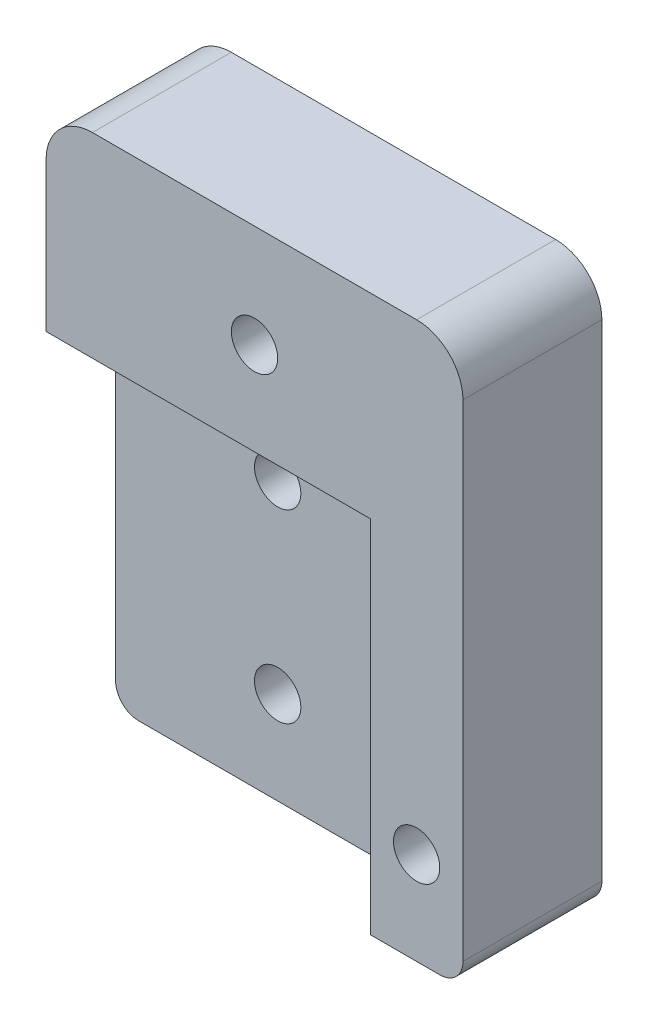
ISO-10303-21;
HEADER;
FILE_DESCRIPTION(('STEP AP214'),'2;1');
FILE_NAME('part.step','',(''),(''),'','','');
FILE_SCHEMA(('AUTOMOTIVE_DESIGN { 1 0 10303 214 1 1 1 1 }'));
ENDSEC;
DATA;
#1=APPLICATION_CONTEXT('core data for automotive mechanical design processes');
#2=APPLICATION_PROTOCOL_DEFINITION('international standard','automotive_design',2000,#1);
#3=PRODUCT_CONTEXT('',#1,'mechanical');
#4=PRODUCT('Part','Part','',(#3));
#5=PRODUCT_RELATED_PRODUCT_CATEGORY('part','',(#4));
#6=PRODUCT_DEFINITION_FORMATION('','',#4);
#7=PRODUCT_DEFINITION_CONTEXT('part definition',#1,'design');
#8=PRODUCT_DEFINITION('design','',#6,#7);
#9=PRODUCT_DEFINITION_SHAPE('','',#8);
#10=(LENGTH_UNIT() NAMED_UNIT(*) SI_UNIT(.MILLI.,.METRE.));
#11=(NAMED_UNIT(*) PLANE_ANGLE_UNIT() SI_UNIT($,.RADIAN.));
#12=(NAMED_UNIT(*) SI_UNIT($,.STERADIAN.) SOLID_ANGLE_UNIT());
#13=UNCERTAINTY_MEASURE_WITH_UNIT(LENGTH_MEASURE(1.E-05),#10,'distance_accuracy_value','');
#14=(GEOMETRIC_REPRESENTATION_CONTEXT(3) GLOBAL_UNCERTAINTY_ASSIGNED_CONTEXT((#13)) GLOBAL_UNIT_ASSIGNED_CONTEXT((#10,
#11,#12)) REPRESENTATION_CONTEXT('',''));
#15=CARTESIAN_POINT('',(0.,0.,0.));
#16=DIRECTION('',(0.,0.,1.));
#17=DIRECTION('',(1.,0.,0.));
#18=AXIS2_PLACEMENT_3D('',#15,#16,#17);
#19=CARTESIAN_POINT('',(3.175,3.175,19.05));
#20=DIRECTION('',(0.,0.,-1.));
#21=DIRECTION('',(-1.,0.,0.));
#22=AXIS2_PLACEMENT_3D('',#19,#20,#21);
#23=CYLINDRICAL_SURFACE('',#22,3.175);
#24=DIRECTION('',(0.,0.,-1.));
#25=VECTOR('',#24,1.);
#26=CARTESIAN_POINT('',(3.17500000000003,0.,19.05));
#27=LINE('',#26,#25);
#28=CARTESIAN_POINT('',(3.17500000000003,0.,9.525));
#29=VERTEX_POINT('',#28);
#30=CARTESIAN_POINT('',(3.17500000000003,0.,0.));
#31=VERTEX_POINT('',#30);
#32=EDGE_CURVE('E142',#29,#31,#27,.T.);
#33=ORIENTED_EDGE('',*,*,#32,.F.);
#34=CARTESIAN_POINT('',(3.175,3.175,9.525));
#35=DIRECTION('',(0.,0.,1.));
#36=DIRECTION('',(1.,0.,0.));
#37=AXIS2_PLACEMENT_3D('',#34,#35,#36);
#38=CIRCLE('',#37,3.175);
#39=CARTESIAN_POINT('',(0.,3.17500000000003,9.525));
#40=VERTEX_POINT('',#39);
#41=EDGE_CURVE('E203',#40,#29,#38,.T.);
#42=ORIENTED_EDGE('',*,*,#41,.F.);
#43=DIRECTION('',(0.,0.,-1.));
#44=VECTOR('',#43,1.);
#45=CARTESIAN_POINT('',(0.,3.17500000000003,19.05));
#46=LINE('',#45,#44);
#47=CARTESIAN_POINT('',(0.,3.17500000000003,0.));
#48=VERTEX_POINT('',#47);
#49=EDGE_CURVE('E139',#40,#48,#46,.T.);
#50=ORIENTED_EDGE('',*,*,#49,.T.);
#51=CARTESIAN_POINT('',(3.175,3.175,0.));
#52=DIRECTION('',(0.,0.,1.));
#53=DIRECTION('',(1.,0.,0.));
#54=AXIS2_PLACEMENT_3D('',#51,#52,#53);
#55=CIRCLE('',#54,3.175);
#56=EDGE_CURVE('E167',#31,#48,#55,.F.);
#57=ORIENTED_EDGE('',*,*,#56,.F.);
#58=EDGE_LOOP('',(#33,#42,#50,#57));
#59=FACE_BOUND('',#58,.T.);
#60=ADVANCED_FACE('F35',(#59),#23,.T.);
#61=CARTESIAN_POINT('',(28.575,0.,19.05));
#62=DIRECTION('',(0.,1.,0.));
#63=DIRECTION('',(0.,0.,1.));
#64=AXIS2_PLACEMENT_3D('',#61,#62,#63);
#65=PLANE('',#64);
#66=DIRECTION('',(0.,0.,1.));
#67=VECTOR('',#66,1.);
#68=CARTESIAN_POINT('',(44.45,0.,9.525));
#69=LINE('',#68,#67);
#70=CARTESIAN_POINT('',(44.45,0.,9.525));
#71=VERTEX_POINT('',#70);
#72=CARTESIAN_POINT('',(44.45,0.,19.05));
#73=VERTEX_POINT('',#72);
#74=EDGE_CURVE('E219',#71,#73,#69,.T.);
#75=ORIENTED_EDGE('',*,*,#74,.F.);
#76=DIRECTION('',(1.,0.,0.));
#77=VECTOR('',#76,1.);
#78=CARTESIAN_POINT('',(28.575,0.,9.525));
#79=LINE('',#78,#77);
#80=EDGE_CURVE('E196',#29,#71,#79,.T.);
#81=ORIENTED_EDGE('',*,*,#80,.F.);
#82=ORIENTED_EDGE('',*,*,#32,.T.);
#83=DIRECTION('',(1.,0.,0.));
#84=VECTOR('',#83,1.);
#85=CARTESIAN_POINT('',(28.575,0.,0.));
#86=LINE('',#85,#84);
#87=CARTESIAN_POINT('',(53.975,0.,0.));
#88=VERTEX_POINT('',#87);
#89=EDGE_CURVE('E170',#31,#88,#86,.T.);
#90=ORIENTED_EDGE('',*,*,#89,.T.);
#91=DIRECTION('',(0.,0.,-1.));
#92=VECTOR('',#91,1.);
#93=CARTESIAN_POINT('',(53.975,0.,19.05));
#94=LINE('',#93,#92);
#95=CARTESIAN_POINT('',(53.975,0.,19.05));
#96=VERTEX_POINT('',#95);
#97=EDGE_CURVE('E185',#96,#88,#94,.T.);
#98=ORIENTED_EDGE('',*,*,#97,.F.);
#99=DIRECTION('',(1.,0.,0.));
#100=VECTOR('',#99,1.);
#101=CARTESIAN_POINT('',(28.575,0.,19.05));
#102=LINE('',#101,#100);
#103=EDGE_CURVE('E124',#73,#96,#102,.T.);
#104=ORIENTED_EDGE('',*,*,#103,.F.);
#105=EDGE_LOOP('',(#75,#81,#82,#90,#98,#104));
#106=FACE_BOUND('',#105,.T.);
#107=ADVANCED_FACE('F192',(#106),#65,.F.);
#108=CARTESIAN_POINT('',(22.225,38.1,19.05));
#109=DIRECTION('',(0.,0.,-1.));
#110=DIRECTION('',(-1.,0.,0.));
#111=AXIS2_PLACEMENT_3D('',#108,#109,#110);
#112=CYLINDRICAL_SURFACE('',#111,3.175);
#113=CARTESIAN_POINT('',(22.225,38.1,0.));
#114=DIRECTION('',(0.,0.,1.));
#115=DIRECTION('',(1.,0.,0.));
#116=AXIS2_PLACEMENT_3D('',#113,#114,#115);
#117=CIRCLE('',#116,3.175);
#118=CARTESIAN_POINT('',(19.05,38.1,0.));
#119=VERTEX_POINT('',#118);
#120=EDGE_CURVE('E173',#119,#119,#117,.T.);
#121=CARTESIAN_POINT('',(22.225,38.1,9.525));
#122=DIRECTION('',(0.,0.,1.));
#123=DIRECTION('',(1.,0.,0.));
#124=AXIS2_PLACEMENT_3D('',#121,#122,#123);
#125=CIRCLE('',#124,3.175);
#126=CARTESIAN_POINT('',(19.05,38.1,9.525));
#127=VERTEX_POINT('',#126);
#128=EDGE_CURVE('E225',#127,#127,#125,.F.);
#129=CARTESIAN_POINT('',(19.05,38.1,0.));
#130=CARTESIAN_POINT('',(19.05,38.1,0.0992187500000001));
#131=CARTESIAN_POINT('',(19.05,38.1,0.1984375));
#132=CARTESIAN_POINT('',(19.05,38.1,0.396875));
#133=CARTESIAN_POINT('',(19.05,38.1,0.49609375));
#134=CARTESIAN_POINT('',(19.05,38.1,0.69453125));
#135=CARTESIAN_POINT('',(19.05,38.1,0.79375));
#136=CARTESIAN_POINT('',(19.05,38.1,0.992187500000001));
#137=CARTESIAN_POINT('',(19.05,38.1,1.09140625));
#138=CARTESIAN_POINT('',(19.05,38.1,1.28984375));
#139=CARTESIAN_POINT('',(19.05,38.1,1.3890625));
#140=CARTESIAN_POINT('',(19.05,38.1,1.5875));
#141=CARTESIAN_POINT('',(19.05,38.1,1.68671875));
#142=CARTESIAN_POINT('',(19.05,38.1,1.88515625));
#143=CARTESIAN_POINT('',(19.05,38.1,1.984375));
#144=CARTESIAN_POINT('',(19.05,38.1,2.1828125));
#145=CARTESIAN_POINT('',(19.05,38.1,2.28203125));
#146=CARTESIAN_POINT('',(19.05,38.1,2.48046875));
#147=CARTESIAN_POINT('',(19.05,38.1,2.5796875));
#148=CARTESIAN_POINT('',(19.05,38.1,2.778125));
#149=CARTESIAN_POINT('',(19.05,38.1,2.87734375));
#150=CARTESIAN_POINT('',(19.05,38.1,3.07578125));
#151=CARTESIAN_POINT('',(19.05,38.1,3.175));
#152=CARTESIAN_POINT('',(19.05,38.1,3.3734375));
#153=CARTESIAN_POINT('',(19.05,38.1,3.47265625));
#154=CARTESIAN_POINT('',(19.05,38.1,3.67109375));
#155=CARTESIAN_POINT('',(19.05,38.1,3.7703125));
#156=CARTESIAN_POINT('',(19.05,38.1,3.96875));
#157=CARTESIAN_POINT('',(19.05,38.1,4.06796875));
#158=CARTESIAN_POINT('',(19.05,38.1,4.26640625));
#159=CARTESIAN_POINT('',(19.05,38.1,4.365625));
#160=CARTESIAN_POINT('',(19.05,38.1,4.5640625));
#161=CARTESIAN_POINT('',(19.05,38.1,4.66328125));
#162=CARTESIAN_POINT('',(19.05,38.1,4.86171875));
#163=CARTESIAN_POINT('',(19.05,38.1,4.9609375));
#164=CARTESIAN_POINT('',(19.05,38.1,5.159375));
#165=CARTESIAN_POINT('',(19.05,38.1,5.25859375));
#166=CARTESIAN_POINT('',(19.05,38.1,5.45703125));
#167=CARTESIAN_POINT('',(19.05,38.1,5.55625));
#168=CARTESIAN_POINT('',(19.05,38.1,5.7546875));
#169=CARTESIAN_POINT('',(19.05,38.1,5.85390625));
#170=CARTESIAN_POINT('',(19.05,38.1,6.05234375));
#171=CARTESIAN_POINT('',(19.05,38.1,6.1515625));
#172=CARTESIAN_POINT('',(19.05,38.1,6.35));
#173=CARTESIAN_POINT('',(19.05,38.1,6.44921875));
#174=CARTESIAN_POINT('',(19.05,38.1,6.64765625));
#175=CARTESIAN_POINT('',(19.05,38.1,6.746875));
#176=CARTESIAN_POINT('',(19.05,38.1,6.9453125));
#177=CARTESIAN_POINT('',(19.05,38.1,7.04453125));
#178=CARTESIAN_POINT('',(19.05,38.1,7.24296875));
#179=CARTESIAN_POINT('',(19.05,38.1,7.3421875));
#180=CARTESIAN_POINT('',(19.05,38.1,7.540625));
#181=CARTESIAN_POINT('',(19.05,38.1,7.63984375));
#182=CARTESIAN_POINT('',(19.05,38.1,7.83828125));
#183=CARTESIAN_POINT('',(19.05,38.1,7.9375));
#184=CARTESIAN_POINT('',(19.05,38.1,8.1359375));
#185=CARTESIAN_POINT('',(19.05,38.1,8.23515625));
#186=CARTESIAN_POINT('',(19.05,38.1,8.43359375));
#187=CARTESIAN_POINT('',(19.05,38.1,8.5328125));
#188=CARTESIAN_POINT('',(19.05,38.1,8.73125));
#189=CARTESIAN_POINT('',(19.05,38.1,8.83046875));
#190=CARTESIAN_POINT('',(19.05,38.1,9.02890625));
#191=CARTESIAN_POINT('',(19.05,38.1,9.128125));
#192=CARTESIAN_POINT('',(19.05,38.1,9.3265625));
#193=CARTESIAN_POINT('',(19.05,38.1,9.42578125));
#194=CARTESIAN_POINT('',(19.05,38.1,9.525));
#195=B_SPLINE_CURVE_WITH_KNOTS('',3,(#129,#130,#131,#132,#133,#134,#135,#136,#137,#138,#139,
#140,#141,#142,#143,#144,#145,#146,#147,#148,#149,#150,#151,#152,#153,#154,#155,#156,#157,#158,
#159,#160,#161,#162,#163,#164,#165,#166,#167,#168,#169,#170,#171,#172,#173,#174,#175,#176,#177,
#178,#179,#180,#181,#182,#183,#184,#185,#186,#187,#188,#189,#190,#191,#192,#193,#194),
.UNSPECIFIED.,.F.,.F.,(4,2,2,2,2,2,2,2,2,2,2,2,2,2,2,2,2,2,2,2,2,2,2,2,2,2,2,2,2,2,2,2,4),(0.,
0.29765625,0.5953125,0.892968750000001,1.190625,1.48828125,1.7859375,2.08359375,2.38125,
2.67890625,2.9765625,3.27421875,3.571875,3.86953125,4.1671875,4.46484375,4.7625,5.06015625,
5.3578125,5.65546875,5.953125,6.25078125,6.5484375,6.84609375,7.14375,7.44140625,7.7390625,
8.03671875,8.334375,8.63203125,8.9296875,9.22734375,9.525),.UNSPECIFIED.);
#196=EDGE_CURVE('BSEAM283',#119,#127,#195,.T.);
#197=ORIENTED_EDGE('',*,*,#120,.F.);
#198=ORIENTED_EDGE('',*,*,#128,.F.);
#199=ORIENTED_EDGE('',*,*,#196,.T.);
#200=ORIENTED_EDGE('',*,*,#196,.F.);
#201=EDGE_LOOP('',(#197,#199,#198,#200));
#202=FACE_BOUND('',#201,.T.);
#203=ADVANCED_FACE('F283',(#202),#112,.F.);
#204=CARTESIAN_POINT('',(22.225,12.7,19.05));
#205=DIRECTION('',(0.,0.,-1.));
#206=DIRECTION('',(-1.,0.,0.));
#207=AXIS2_PLACEMENT_3D('',#204,#205,#206);
#208=CYLINDRICAL_SURFACE('',#207,3.175);
#209=CARTESIAN_POINT('',(22.225,12.7,0.));
#210=DIRECTION('',(0.,0.,1.));
#211=DIRECTION('',(1.,0.,0.));
#212=AXIS2_PLACEMENT_3D('',#209,#210,#211);
#213=CIRCLE('',#212,3.175);
#214=CARTESIAN_POINT('',(19.05,12.7,0.));
#215=VERTEX_POINT('',#214);
#216=EDGE_CURVE('E245',#215,#215,#213,.T.);
#217=CARTESIAN_POINT('',(22.225,12.7,9.525));
#218=DIRECTION('',(0.,0.,1.));
#219=DIRECTION('',(1.,0.,0.));
#220=AXIS2_PLACEMENT_3D('',#217,#218,#219);
#221=CIRCLE('',#220,3.175);
#222=CARTESIAN_POINT('',(19.05,12.7,9.525));
#223=VERTEX_POINT('',#222);
#224=EDGE_CURVE('E237',#223,#223,#221,.F.);
#225=CARTESIAN_POINT('',(19.05,12.7,0.));
#226=CARTESIAN_POINT('',(19.05,12.7,0.0992187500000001));
#227=CARTESIAN_POINT('',(19.05,12.7,0.1984375));
#228=CARTESIAN_POINT('',(19.05,12.7,0.396875));
#229=CARTESIAN_POINT('',(19.05,12.7,0.49609375));
#230=CARTESIAN_POINT('',(19.05,12.7,0.69453125));
#231=CARTESIAN_POINT('',(19.05,12.7,0.79375));
#232=CARTESIAN_POINT('',(19.05,12.7,0.992187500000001));
#233=CARTESIAN_POINT('',(19.05,12.7,1.09140625));
#234=CARTESIAN_POINT('',(19.05,12.7,1.28984375));
#235=CARTESIAN_POINT('',(19.05,12.7,1.3890625));
#236=CARTESIAN_POINT('',(19.05,12.7,1.5875));
#237=CARTESIAN_POINT('',(19.05,12.7,1.68671875));
#238=CARTESIAN_POINT('',(19.05,12.7,1.88515625));
#239=CARTESIAN_POINT('',(19.05,12.7,1.984375));
#240=CARTESIAN_POINT('',(19.05,12.7,2.1828125));
#241=CARTESIAN_POINT('',(19.05,12.7,2.28203125));
#242=CARTESIAN_POINT('',(19.05,12.7,2.48046875));
#243=CARTESIAN_POINT('',(19.05,12.7,2.5796875));
#244=CARTESIAN_POINT('',(19.05,12.7,2.778125));
#245=CARTESIAN_POINT('',(19.05,12.7,2.87734375));
#246=CARTESIAN_POINT('',(19.05,12.7,3.07578125));
#247=CARTESIAN_POINT('',(19.05,12.7,3.175));
#248=CARTESIAN_POINT('',(19.05,12.7,3.3734375));
#249=CARTESIAN_POINT('',(19.05,12.7,3.47265625));
#250=CARTESIAN_POINT('',(19.05,12.7,3.67109375));
#251=CARTESIAN_POINT('',(19.05,12.7,3.7703125));
#252=CARTESIAN_POINT('',(19.05,12.7,3.96875));
#253=CARTESIAN_POINT('',(19.05,12.7,4.06796875));
#254=CARTESIAN_POINT('',(19.05,12.7,4.26640625));
#255=CARTESIAN_POINT('',(19.05,12.7,4.365625));
#256=CARTESIAN_POINT('',(19.05,12.7,4.5640625));
#257=CARTESIAN_POINT('',(19.05,12.7,4.66328125));
#258=CARTESIAN_POINT('',(19.05,12.7,4.86171875));
#259=CARTESIAN_POINT('',(19.05,12.7,4.9609375));
#260=CARTESIAN_POINT('',(19.05,12.7,5.159375));
#261=CARTESIAN_POINT('',(19.05,12.7,5.25859375));
#262=CARTESIAN_POINT('',(19.05,12.7,5.45703125));
#263=CARTESIAN_POINT('',(19.05,12.7,5.55625));
#264=CARTESIAN_POINT('',(19.05,12.7,5.7546875));
#265=CARTESIAN_POINT('',(19.05,12.7,5.85390625));
#266=CARTESIAN_POINT('',(19.05,12.7,6.05234375));
#267=CARTESIAN_POINT('',(19.05,12.7,6.1515625));
#268=CARTESIAN_POINT('',(19.05,12.7,6.35));
#269=CARTESIAN_POINT('',(19.05,12.7,6.44921875));
#270=CARTESIAN_POINT('',(19.05,12.7,6.64765625));
#271=CARTESIAN_POINT('',(19.05,12.7,6.746875));
#272=CARTESIAN_POINT('',(19.05,12.7,6.9453125));
#273=CARTESIAN_POINT('',(19.05,12.7,7.04453125));
#274=CARTESIAN_POINT('',(19.05,12.7,7.24296875));
#275=CARTESIAN_POINT('',(19.05,12.7,7.3421875));
#276=CARTESIAN_POINT('',(19.05,12.7,7.540625));
#277=CARTESIAN_POINT('',(19.05,12.7,7.63984375));
#278=CARTESIAN_POINT('',(19.05,12.7,7.83828125));
#279=CARTESIAN_POINT('',(19.05,12.7,7.9375));
#280=CARTESIAN_POINT('',(19.05,12.7,8.1359375));
#281=CARTESIAN_POINT('',(19.05,12.7,8.23515625));
#282=CARTESIAN_POINT('',(19.05,12.7,8.43359375));
#283=CARTESIAN_POINT('',(19.05,12.7,8.5328125));
#284=CARTESIAN_POINT('',(19.05,12.7,8.73125));
#285=CARTESIAN_POINT('',(19.05,12.7,8.83046875));
#286=CARTESIAN_POINT('',(19.05,12.7,9.02890625));
#287=CARTESIAN_POINT('',(19.05,12.7,9.128125));
#288=CARTESIAN_POINT('',(19.05,12.7,9.3265625));
#289=CARTESIAN_POINT('',(19.05,12.7,9.42578125));
#290=CARTESIAN_POINT('',(19.05,12.7,9.525));
#291=B_SPLINE_CURVE_WITH_KNOTS('',3,(#225,#226,#227,#228,#229,#230,#231,#232,#233,#234,#235,
#236,#237,#238,#239,#240,#241,#242,#243,#244,#245,#246,#247,#248,#249,#250,#251,#252,#253,#254,
#255,#256,#257,#258,#259,#260,#261,#262,#263,#264,#265,#266,#267,#268,#269,#270,#271,#272,#273,
#274,#275,#276,#277,#278,#279,#280,#281,#282,#283,#284,#285,#286,#287,#288,#289,#290),
.UNSPECIFIED.,.F.,.F.,(4,2,2,2,2,2,2,2,2,2,2,2,2,2,2,2,2,2,2,2,2,2,2,2,2,2,2,2,2,2,2,2,4),(0.,
0.29765625,0.5953125,0.892968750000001,1.190625,1.48828125,1.7859375,2.08359375,2.38125,
2.67890625,2.9765625,3.27421875,3.571875,3.86953125,4.1671875,4.46484375,4.7625,5.06015625,
5.3578125,5.65546875,5.953125,6.25078125,6.5484375,6.84609375,7.14375,7.44140625,7.7390625,
8.03671875,8.334375,8.63203125,8.9296875,9.22734375,9.525),.UNSPECIFIED.);
#292=EDGE_CURVE('BSEAM37',#215,#223,#291,.T.);
#293=ORIENTED_EDGE('',*,*,#216,.F.);
#294=ORIENTED_EDGE('',*,*,#224,.F.);
#295=ORIENTED_EDGE('',*,*,#292,.T.);
#296=ORIENTED_EDGE('',*,*,#292,.F.);
#297=EDGE_LOOP('',(#293,#295,#294,#296));
#298=FACE_BOUND('',#297,.T.);
#299=ADVANCED_FACE('F37',(#298),#208,.F.);
#300=CARTESIAN_POINT('',(28.575,-36.1285343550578,19.05));
#301=DIRECTION('',(0.,0.,1.));
#302=DIRECTION('',(1.,0.,0.));
#303=AXIS2_PLACEMENT_3D('',#300,#301,#302);
#304=PLANE('',#303);
#305=CARTESIAN_POINT('',(28.575,62.096854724,19.05));
#306=DIRECTION('',(0.,0.,1.));
#307=DIRECTION('',(1.,0.,0.));
#308=AXIS2_PLACEMENT_3D('',#305,#306,#307);
#309=CIRCLE('',#308,3.175);
#310=CARTESIAN_POINT('',(25.4,62.096854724,19.05));
#311=VERTEX_POINT('',#310);
#312=EDGE_CURVE('E186',#311,#311,#309,.T.);
#313=ORIENTED_EDGE('',*,*,#312,.F.);
#314=EDGE_LOOP('',(#313));
#315=FACE_BOUND('',#314,.T.);
#316=CARTESIAN_POINT('',(50.8,12.7,19.05));
#317=DIRECTION('',(0.,0.,1.));
#318=DIRECTION('',(1.,0.,0.));
#319=AXIS2_PLACEMENT_3D('',#316,#317,#318);
#320=CIRCLE('',#319,3.175);
#321=CARTESIAN_POINT('',(47.625,12.7,19.05));
#322=VERTEX_POINT('',#321);
#323=EDGE_CURVE('E252',#322,#322,#320,.T.);
#324=ORIENTED_EDGE('',*,*,#323,.F.);
#325=EDGE_LOOP('',(#324));
#326=FACE_BOUND('',#325,.T.);
#327=DIRECTION('',(-1.,0.,0.));
#328=VECTOR('',#327,1.);
#329=CARTESIAN_POINT('',(28.575,49.396854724,19.05));
#330=LINE('',#329,#328);
#331=CARTESIAN_POINT('',(44.45,49.396854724,19.05));
#332=VERTEX_POINT('',#331);
#333=CARTESIAN_POINT('',(0.,49.396854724,19.05));
#334=VERTEX_POINT('',#333);
#335=EDGE_CURVE('E218',#332,#334,#330,.T.);
#336=ORIENTED_EDGE('',*,*,#335,.F.);
#337=DIRECTION('',(0.,-1.,0.));
#338=VECTOR('',#337,1.);
#339=CARTESIAN_POINT('',(44.45,-36.1285343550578,19.05));
#340=LINE('',#339,#338);
#341=EDGE_CURVE('E50',#332,#73,#340,.T.);
#342=ORIENTED_EDGE('',*,*,#341,.T.);
#343=ORIENTED_EDGE('',*,*,#103,.T.);
#344=CARTESIAN_POINT('',(53.975,3.175,19.05));
#345=DIRECTION('',(0.,0.,1.));
#346=DIRECTION('',(1.,0.,0.));
#347=AXIS2_PLACEMENT_3D('',#344,#345,#346);
#348=CIRCLE('',#347,3.175);
#349=CARTESIAN_POINT('',(57.15,3.17500000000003,19.05));
#350=VERTEX_POINT('',#349);
#351=EDGE_CURVE('E59',#96,#350,#348,.T.);
#352=ORIENTED_EDGE('',*,*,#351,.T.);
#353=DIRECTION('',(0.,1.,0.));
#354=VECTOR('',#353,1.);
#355=CARTESIAN_POINT('',(57.15,-36.1285343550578,19.05));
#356=LINE('',#355,#354);
#357=CARTESIAN_POINT('',(57.15,69.85,19.05));
#358=VERTEX_POINT('',#357);
#359=EDGE_CURVE('E182',#350,#358,#356,.T.);
#360=ORIENTED_EDGE('',*,*,#359,.T.);
#361=CARTESIAN_POINT('',(50.8,69.85,19.05));
#362=DIRECTION('',(0.,0.,1.));
#363=DIRECTION('',(1.,0.,0.));
#364=AXIS2_PLACEMENT_3D('',#361,#362,#363);
#365=CIRCLE('',#364,6.35);
#366=CARTESIAN_POINT('',(50.8,76.2,19.05));
#367=VERTEX_POINT('',#366);
#368=EDGE_CURVE('E100',#358,#367,#365,.T.);
#369=ORIENTED_EDGE('',*,*,#368,.T.);
#370=DIRECTION('',(1.,0.,0.));
#371=VECTOR('',#370,1.);
#372=CARTESIAN_POINT('',(28.575,76.2,19.05));
#373=LINE('',#372,#371);
#374=CARTESIAN_POINT('',(6.35000000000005,76.2,19.05));
#375=VERTEX_POINT('',#374);
#376=EDGE_CURVE('E131',#375,#367,#373,.T.);
#377=ORIENTED_EDGE('',*,*,#376,.F.);
#378=CARTESIAN_POINT('',(6.35,69.85,19.05));
#379=DIRECTION('',(0.,0.,1.));
#380=DIRECTION('',(1.,0.,0.));
#381=AXIS2_PLACEMENT_3D('',#378,#379,#380);
#382=CIRCLE('',#381,6.35);
#383=CARTESIAN_POINT('',(0.,69.85,19.05));
#384=VERTEX_POINT('',#383);
#385=EDGE_CURVE('E125',#375,#384,#382,.T.);
#386=ORIENTED_EDGE('',*,*,#385,.T.);
#387=DIRECTION('',(0.,1.,0.));
#388=VECTOR('',#387,1.);
#389=CARTESIAN_POINT('',(0.,-36.1285343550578,19.05));
#390=LINE('',#389,#388);
#391=EDGE_CURVE('E112',#334,#384,#390,.T.);
#392=ORIENTED_EDGE('',*,*,#391,.F.);
#393=EDGE_LOOP('',(#336,#342,#343,#352,#360,#369,#377,#386,#392));
#394=FACE_BOUND('',#393,.T.);
#395=ADVANCED_FACE('F129',(#315,#326,#394),#304,.T.);
#396=CARTESIAN_POINT('',(57.15,-36.1285343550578,19.05));
#397=DIRECTION('',(-1.,0.,0.));
#398=DIRECTION('',(0.,0.,1.));
#399=AXIS2_PLACEMENT_3D('',#396,#397,#398);
#400=PLANE('',#399);
#401=DIRECTION('',(0.,1.,0.));
#402=VECTOR('',#401,1.);
#403=CARTESIAN_POINT('',(57.15,-36.1285343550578,0.));
#404=LINE('',#403,#402);
#405=CARTESIAN_POINT('',(57.15,3.17500000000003,0.));
#406=VERTEX_POINT('',#405);
#407=CARTESIAN_POINT('',(57.15,69.85,0.));
#408=VERTEX_POINT('',#407);
#409=EDGE_CURVE('E157',#406,#408,#404,.T.);
#410=ORIENTED_EDGE('',*,*,#409,.T.);
#411=DIRECTION('',(0.,0.,-1.));
#412=VECTOR('',#411,1.);
#413=CARTESIAN_POINT('',(57.15,69.85,19.05));
#414=LINE('',#413,#412);
#415=EDGE_CURVE('E11',#358,#408,#414,.T.);
#416=ORIENTED_EDGE('',*,*,#415,.F.);
#417=ORIENTED_EDGE('',*,*,#359,.F.);
#418=DIRECTION('',(0.,0.,-1.));
#419=VECTOR('',#418,1.);
#420=CARTESIAN_POINT('',(57.15,3.17500000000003,19.05));
#421=LINE('',#420,#419);
#422=EDGE_CURVE('E183',#350,#406,#421,.T.);
#423=ORIENTED_EDGE('',*,*,#422,.T.);
#424=EDGE_LOOP('',(#410,#416,#417,#423));
#425=FACE_BOUND('',#424,.T.);
#426=ADVANCED_FACE('F259',(#425),#400,.F.);
#427=CARTESIAN_POINT('',(50.8,69.85,19.05));
#428=DIRECTION('',(0.,0.,-1.));
#429=DIRECTION('',(-1.,0.,0.));
#430=AXIS2_PLACEMENT_3D('',#427,#428,#429);
#431=CYLINDRICAL_SURFACE('',#430,6.35);
#432=CARTESIAN_POINT('',(50.8,69.85,0.));
#433=DIRECTION('',(0.,0.,1.));
#434=DIRECTION('',(1.,0.,0.));
#435=AXIS2_PLACEMENT_3D('',#432,#433,#434);
#436=CIRCLE('',#435,6.35);
#437=CARTESIAN_POINT('',(50.8,76.2,0.));
#438=VERTEX_POINT('',#437);
#439=EDGE_CURVE('E151',#408,#438,#436,.T.);
#440=ORIENTED_EDGE('',*,*,#439,.T.);
#441=DIRECTION('',(0.,0.,-1.));
#442=VECTOR('',#441,1.);
#443=CARTESIAN_POINT('',(50.8,76.2,19.05));
#444=LINE('',#443,#442);
#445=EDGE_CURVE('E43',#367,#438,#444,.T.);
#446=ORIENTED_EDGE('',*,*,#445,.F.);
#447=ORIENTED_EDGE('',*,*,#368,.F.);
#448=ORIENTED_EDGE('',*,*,#415,.T.);
#449=EDGE_LOOP('',(#440,#446,#447,#448));
#450=FACE_BOUND('',#449,.T.);
#451=ADVANCED_FACE('F152',(#450),#431,.T.);
#452=CARTESIAN_POINT('',(28.575,76.2,19.05));
#453=DIRECTION('',(0.,1.,0.));
#454=DIRECTION('',(0.,0.,1.));
#455=AXIS2_PLACEMENT_3D('',#452,#453,#454);
#456=PLANE('',#455);
#457=DIRECTION('',(1.,0.,0.));
#458=VECTOR('',#457,1.);
#459=CARTESIAN_POINT('',(28.575,76.2,0.));
#460=LINE('',#459,#458);
#461=CARTESIAN_POINT('',(6.35000000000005,76.2,0.));
#462=VERTEX_POINT('',#461);
#463=EDGE_CURVE('E150',#462,#438,#460,.T.);
#464=ORIENTED_EDGE('',*,*,#463,.F.);
#465=DIRECTION('',(0.,0.,-1.));
#466=VECTOR('',#465,1.);
#467=CARTESIAN_POINT('',(6.35000000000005,76.2,19.05));
#468=LINE('',#467,#466);
#469=EDGE_CURVE('E138',#375,#462,#468,.T.);
#470=ORIENTED_EDGE('',*,*,#469,.F.);
#471=ORIENTED_EDGE('',*,*,#376,.T.);
#472=ORIENTED_EDGE('',*,*,#445,.T.);
#473=EDGE_LOOP('',(#464,#470,#471,#472));
#474=FACE_BOUND('',#473,.T.);
#475=ADVANCED_FACE('F148',(#474),#456,.T.);
#476=CARTESIAN_POINT('',(6.35,69.85,19.05));
#477=DIRECTION('',(0.,0.,-1.));
#478=DIRECTION('',(-1.,0.,0.));
#479=AXIS2_PLACEMENT_3D('',#476,#477,#478);
#480=CYLINDRICAL_SURFACE('',#479,6.35);
#481=CARTESIAN_POINT('',(6.35,69.85,0.));
#482=DIRECTION('',(0.,0.,1.));
#483=DIRECTION('',(1.,0.,0.));
#484=AXIS2_PLACEMENT_3D('',#481,#482,#483);
#485=CIRCLE('',#484,6.35);
#486=CARTESIAN_POINT('',(0.,69.85,0.));
#487=VERTEX_POINT('',#486);
#488=EDGE_CURVE('E136',#462,#487,#485,.T.);
#489=ORIENTED_EDGE('',*,*,#488,.T.);
#490=DIRECTION('',(0.,0.,-1.));
#491=VECTOR('',#490,1.);
#492=CARTESIAN_POINT('',(0.,69.85,19.05));
#493=LINE('',#492,#491);
#494=EDGE_CURVE('E117',#384,#487,#493,.T.);
#495=ORIENTED_EDGE('',*,*,#494,.F.);
#496=ORIENTED_EDGE('',*,*,#385,.F.);
#497=ORIENTED_EDGE('',*,*,#469,.T.);
#498=EDGE_LOOP('',(#489,#495,#496,#497));
#499=FACE_BOUND('',#498,.T.);
#500=ADVANCED_FACE('F134',(#499),#480,.T.);
#501=CARTESIAN_POINT('',(0.,-36.1285343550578,19.05));
#502=DIRECTION('',(-1.,0.,0.));
#503=DIRECTION('',(0.,0.,1.));
#504=AXIS2_PLACEMENT_3D('',#501,#502,#503);
#505=PLANE('',#504);
#506=DIRECTION('',(0.,0.,1.));
#507=VECTOR('',#506,1.);
#508=CARTESIAN_POINT('',(0.,49.396854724,9.525));
#509=LINE('',#508,#507);
#510=CARTESIAN_POINT('',(0.,49.396854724,9.525));
#511=VERTEX_POINT('',#510);
#512=EDGE_CURVE('E122',#511,#334,#509,.T.);
#513=ORIENTED_EDGE('',*,*,#512,.T.);
#514=ORIENTED_EDGE('',*,*,#391,.T.);
#515=ORIENTED_EDGE('',*,*,#494,.T.);
#516=DIRECTION('',(0.,1.,0.));
#517=VECTOR('',#516,1.);
#518=CARTESIAN_POINT('',(0.,-36.1285343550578,0.));
#519=LINE('',#518,#517);
#520=EDGE_CURVE('E162',#48,#487,#519,.T.);
#521=ORIENTED_EDGE('',*,*,#520,.F.);
#522=ORIENTED_EDGE('',*,*,#49,.F.);
#523=DIRECTION('',(0.,-1.,0.));
#524=VECTOR('',#523,1.);
#525=CARTESIAN_POINT('',(0.,-36.1285343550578,9.525));
#526=LINE('',#525,#524);
#527=EDGE_CURVE('E206',#511,#40,#526,.T.);
#528=ORIENTED_EDGE('',*,*,#527,.F.);
#529=EDGE_LOOP('',(#513,#514,#515,#521,#522,#528));
#530=FACE_BOUND('',#529,.T.);
#531=ADVANCED_FACE('F114',(#530),#505,.T.);
#532=CARTESIAN_POINT('',(50.8,12.7,19.05));
#533=DIRECTION('',(0.,0.,-1.));
#534=DIRECTION('',(-1.,0.,0.));
#535=AXIS2_PLACEMENT_3D('',#532,#533,#534);
#536=CYLINDRICAL_SURFACE('',#535,3.175);
#537=CARTESIAN_POINT('',(50.8,12.7,0.));
#538=DIRECTION('',(0.,0.,1.));
#539=DIRECTION('',(1.,0.,0.));
#540=AXIS2_PLACEMENT_3D('',#537,#538,#539);
#541=CIRCLE('',#540,3.175);
#542=CARTESIAN_POINT('',(47.625,12.7,0.));
#543=VERTEX_POINT('',#542);
#544=EDGE_CURVE('E176',#543,#543,#541,.T.);
#545=CARTESIAN_POINT('',(47.625,12.7,19.05));
#546=CARTESIAN_POINT('',(47.625,12.7,18.8515625));
#547=CARTESIAN_POINT('',(47.625,12.7,18.653125));
#548=CARTESIAN_POINT('',(47.625,12.7,18.25625));
#549=CARTESIAN_POINT('',(47.625,12.7,18.0578125));
#550=CARTESIAN_POINT('',(47.625,12.7,17.6609375));
#551=CARTESIAN_POINT('',(47.625,12.7,17.4625));
#552=CARTESIAN_POINT('',(47.625,12.7,17.065625));
#553=CARTESIAN_POINT('',(47.625,12.7,16.8671875));
#554=CARTESIAN_POINT('',(47.625,12.7,16.4703125));
#555=CARTESIAN_POINT('',(47.625,12.7,16.271875));
#556=CARTESIAN_POINT('',(47.625,12.7,15.875));
#557=CARTESIAN_POINT('',(47.625,12.7,15.6765625));
#558=CARTESIAN_POINT('',(47.625,12.7,15.2796875));
#559=CARTESIAN_POINT('',(47.625,12.7,15.08125));
#560=CARTESIAN_POINT('',(47.625,12.7,14.684375));
#561=CARTESIAN_POINT('',(47.625,12.7,14.4859375));
#562=CARTESIAN_POINT('',(47.625,12.7,14.0890625));
#563=CARTESIAN_POINT('',(47.625,12.7,13.890625));
#564=CARTESIAN_POINT('',(47.625,12.7,13.49375));
#565=CARTESIAN_POINT('',(47.625,12.7,13.2953125));
#566=CARTESIAN_POINT('',(47.625,12.7,12.8984375));
#567=CARTESIAN_POINT('',(47.625,12.7,12.7));
#568=CARTESIAN_POINT('',(47.625,12.7,12.303125));
#569=CARTESIAN_POINT('',(47.625,12.7,12.1046875));
#570=CARTESIAN_POINT('',(47.625,12.7,11.7078125));
#571=CARTESIAN_POINT('',(47.625,12.7,11.509375));
#572=CARTESIAN_POINT('',(47.625,12.7,11.1125));
#573=CARTESIAN_POINT('',(47.625,12.7,10.9140625));
#574=CARTESIAN_POINT('',(47.625,12.7,10.5171875));
#575=CARTESIAN_POINT('',(47.625,12.7,10.31875));
#576=CARTESIAN_POINT('',(47.625,12.7,9.921875));
#577=CARTESIAN_POINT('',(47.625,12.7,9.7234375));
#578=CARTESIAN_POINT('',(47.625,12.7,9.3265625));
#579=CARTESIAN_POINT('',(47.625,12.7,9.128125));
#580=CARTESIAN_POINT('',(47.625,12.7,8.73125));
#581=CARTESIAN_POINT('',(47.625,12.7,8.5328125));
#582=CARTESIAN_POINT('',(47.625,12.7,8.1359375));
#583=CARTESIAN_POINT('',(47.625,12.7,7.9375));
#584=CARTESIAN_POINT('',(47.625,12.7,7.540625));
#585=CARTESIAN_POINT('',(47.625,12.7,7.3421875));
#586=CARTESIAN_POINT('',(47.625,12.7,6.9453125));
#587=CARTESIAN_POINT('',(47.625,12.7,6.746875));
#588=CARTESIAN_POINT('',(47.625,12.7,6.35));
#589=CARTESIAN_POINT('',(47.625,12.7,6.1515625));
#590=CARTESIAN_POINT('',(47.625,12.7,5.7546875));
#591=CARTESIAN_POINT('',(47.625,12.7,5.55625));
#592=CARTESIAN_POINT('',(47.625,12.7,5.159375));
#593=CARTESIAN_POINT('',(47.625,12.7,4.9609375));
#594=CARTESIAN_POINT('',(47.625,12.7,4.5640625));
#595=CARTESIAN_POINT('',(47.625,12.7,4.365625));
#596=CARTESIAN_POINT('',(47.625,12.7,3.96875));
#597=CARTESIAN_POINT('',(47.625,12.7,3.7703125));
#598=CARTESIAN_POINT('',(47.625,12.7,3.3734375));
#599=CARTESIAN_POINT('',(47.625,12.7,3.175));
#600=CARTESIAN_POINT('',(47.625,12.7,2.778125));
#601=CARTESIAN_POINT('',(47.625,12.7,2.5796875));
#602=CARTESIAN_POINT('',(47.625,12.7,2.1828125));
#603=CARTESIAN_POINT('',(47.625,12.7,1.984375));
#604=CARTESIAN_POINT('',(47.625,12.7,1.5875));
#605=CARTESIAN_POINT('',(47.625,12.7,1.3890625));
#606=CARTESIAN_POINT('',(47.625,12.7,0.992187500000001));
#607=CARTESIAN_POINT('',(47.625,12.7,0.793750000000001));
#608=CARTESIAN_POINT('',(47.625,12.7,0.396875));
#609=CARTESIAN_POINT('',(47.625,12.7,0.1984375));
#610=CARTESIAN_POINT('',(47.625,12.7,0.));
#611=B_SPLINE_CURVE_WITH_KNOTS('',3,(#545,#546,#547,#548,#549,#550,#551,#552,#553,#554,#555,
#556,#557,#558,#559,#560,#561,#562,#563,#564,#565,#566,#567,#568,#569,#570,#571,#572,#573,#574,
#575,#576,#577,#578,#579,#580,#581,#582,#583,#584,#585,#586,#587,#588,#589,#590,#591,#592,#593,
#594,#595,#596,#597,#598,#599,#600,#601,#602,#603,#604,#605,#606,#607,#608,#609,#610),
.UNSPECIFIED.,.F.,.F.,(4,2,2,2,2,2,2,2,2,2,2,2,2,2,2,2,2,2,2,2,2,2,2,2,2,2,2,2,2,2,2,2,4),(0.,
0.595312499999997,1.190625,1.7859375,2.38125,2.9765625,3.571875,4.1671875,4.7625,5.3578125,
5.953125,6.5484375,7.14375,7.7390625,8.334375,8.9296875,9.525,10.1203125,10.715625,11.3109375,
11.90625,12.5015625,13.096875,13.6921875,14.2875,14.8828125,15.478125,16.0734375,16.66875,
17.2640625,17.859375,18.4546875,19.05),.UNSPECIFIED.);
#612=EDGE_CURVE('BSEAM265',#322,#543,#611,.T.);
#613=ORIENTED_EDGE('',*,*,#323,.T.);
#614=ORIENTED_EDGE('',*,*,#544,.F.);
#615=ORIENTED_EDGE('',*,*,#612,.T.);
#616=ORIENTED_EDGE('',*,*,#612,.F.);
#617=EDGE_LOOP('',(#613,#615,#614,#616));
#618=FACE_BOUND('',#617,.T.);
#619=ADVANCED_FACE('F265',(#618),#536,.F.);
#620=CARTESIAN_POINT('',(53.975,3.175,19.05));
#621=DIRECTION('',(0.,0.,-1.));
#622=DIRECTION('',(-1.,0.,0.));
#623=AXIS2_PLACEMENT_3D('',#620,#621,#622);
#624=CYLINDRICAL_SURFACE('',#623,3.175);
#625=CARTESIAN_POINT('',(53.975,3.175,0.));
#626=DIRECTION('',(0.,0.,1.));
#627=DIRECTION('',(1.,0.,0.));
#628=AXIS2_PLACEMENT_3D('',#625,#626,#627);
#629=CIRCLE('',#628,3.175);
#630=EDGE_CURVE('E92',#88,#406,#629,.T.);
#631=ORIENTED_EDGE('',*,*,#630,.T.);
#632=ORIENTED_EDGE('',*,*,#422,.F.);
#633=ORIENTED_EDGE('',*,*,#351,.F.);
#634=ORIENTED_EDGE('',*,*,#97,.T.);
#635=EDGE_LOOP('',(#631,#632,#633,#634));
#636=FACE_BOUND('',#635,.T.);
#637=ADVANCED_FACE('F261',(#636),#624,.T.);
#638=CARTESIAN_POINT('',(28.575,62.096854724,19.05));
#639=DIRECTION('',(0.,0.,-1.));
#640=DIRECTION('',(-1.,0.,0.));
#641=AXIS2_PLACEMENT_3D('',#638,#639,#640);
#642=CYLINDRICAL_SURFACE('',#641,3.175);
#643=CARTESIAN_POINT('',(28.575,62.096854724,0.));
#644=DIRECTION('',(0.,0.,1.));
#645=DIRECTION('',(1.,0.,0.));
#646=AXIS2_PLACEMENT_3D('',#643,#644,#645);
#647=CIRCLE('',#646,3.175);
#648=CARTESIAN_POINT('',(25.4,62.096854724,0.));
#649=VERTEX_POINT('',#648);
#650=EDGE_CURVE('E179',#649,#649,#647,.T.);
#651=CARTESIAN_POINT('',(25.4,62.096854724,19.05));
#652=CARTESIAN_POINT('',(25.4,62.096854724,18.8515625));
#653=CARTESIAN_POINT('',(25.4,62.096854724,18.653125));
#654=CARTESIAN_POINT('',(25.4,62.096854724,18.25625));
#655=CARTESIAN_POINT('',(25.4,62.096854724,18.0578125));
#656=CARTESIAN_POINT('',(25.4,62.096854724,17.6609375));
#657=CARTESIAN_POINT('',(25.4,62.096854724,17.4625));
#658=CARTESIAN_POINT('',(25.4,62.096854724,17.065625));
#659=CARTESIAN_POINT('',(25.4,62.096854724,16.8671875));
#660=CARTESIAN_POINT('',(25.4,62.096854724,16.4703125));
#661=CARTESIAN_POINT('',(25.4,62.096854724,16.271875));
#662=CARTESIAN_POINT('',(25.4,62.096854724,15.875));
#663=CARTESIAN_POINT('',(25.4,62.096854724,15.6765625));
#664=CARTESIAN_POINT('',(25.4,62.096854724,15.2796875));
#665=CARTESIAN_POINT('',(25.4,62.096854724,15.08125));
#666=CARTESIAN_POINT('',(25.4,62.096854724,14.684375));
#667=CARTESIAN_POINT('',(25.4,62.096854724,14.4859375));
#668=CARTESIAN_POINT('',(25.4,62.096854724,14.0890625));
#669=CARTESIAN_POINT('',(25.4,62.096854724,13.890625));
#670=CARTESIAN_POINT('',(25.4,62.096854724,13.49375));
#671=CARTESIAN_POINT('',(25.4,62.096854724,13.2953125));
#672=CARTESIAN_POINT('',(25.4,62.096854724,12.8984375));
#673=CARTESIAN_POINT('',(25.4,62.096854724,12.7));
#674=CARTESIAN_POINT('',(25.4,62.096854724,12.303125));
#675=CARTESIAN_POINT('',(25.4,62.096854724,12.1046875));
#676=CARTESIAN_POINT('',(25.4,62.096854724,11.7078125));
#677=CARTESIAN_POINT('',(25.4,62.096854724,11.509375));
#678=CARTESIAN_POINT('',(25.4,62.096854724,11.1125));
#679=CARTESIAN_POINT('',(25.4,62.096854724,10.9140625));
#680=CARTESIAN_POINT('',(25.4,62.096854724,10.5171875));
#681=CARTESIAN_POINT('',(25.4,62.096854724,10.31875));
#682=CARTESIAN_POINT('',(25.4,62.096854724,9.921875));
#683=CARTESIAN_POINT('',(25.4,62.096854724,9.7234375));
#684=CARTESIAN_POINT('',(25.4,62.096854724,9.3265625));
#685=CARTESIAN_POINT('',(25.4,62.096854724,9.128125));
#686=CARTESIAN_POINT('',(25.4,62.096854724,8.73125));
#687=CARTESIAN_POINT('',(25.4,62.096854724,8.5328125));
#688=CARTESIAN_POINT('',(25.4,62.096854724,8.1359375));
#689=CARTESIAN_POINT('',(25.4,62.096854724,7.9375));
#690=CARTESIAN_POINT('',(25.4,62.096854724,7.540625));
#691=CARTESIAN_POINT('',(25.4,62.096854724,7.3421875));
#692=CARTESIAN_POINT('',(25.4,62.096854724,6.9453125));
#693=CARTESIAN_POINT('',(25.4,62.096854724,6.746875));
#694=CARTESIAN_POINT('',(25.4,62.096854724,6.35));
#695=CARTESIAN_POINT('',(25.4,62.096854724,6.1515625));
#696=CARTESIAN_POINT('',(25.4,62.096854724,5.7546875));
#697=CARTESIAN_POINT('',(25.4,62.096854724,5.55625));
#698=CARTESIAN_POINT('',(25.4,62.096854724,5.159375));
#699=CARTESIAN_POINT('',(25.4,62.096854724,4.9609375));
#700=CARTESIAN_POINT('',(25.4,62.096854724,4.5640625));
#701=CARTESIAN_POINT('',(25.4,62.096854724,4.365625));
#702=CARTESIAN_POINT('',(25.4,62.096854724,3.96875));
#703=CARTESIAN_POINT('',(25.4,62.096854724,3.7703125));
#704=CARTESIAN_POINT('',(25.4,62.096854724,3.3734375));
#705=CARTESIAN_POINT('',(25.4,62.096854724,3.175));
#706=CARTESIAN_POINT('',(25.4,62.096854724,2.778125));
#707=CARTESIAN_POINT('',(25.4,62.096854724,2.5796875));
#708=CARTESIAN_POINT('',(25.4,62.096854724,2.1828125));
#709=CARTESIAN_POINT('',(25.4,62.096854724,1.984375));
#710=CARTESIAN_POINT('',(25.4,62.096854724,1.5875));
#711=CARTESIAN_POINT('',(25.4,62.096854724,1.3890625));
#712=CARTESIAN_POINT('',(25.4,62.096854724,0.992187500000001));
#713=CARTESIAN_POINT('',(25.4,62.096854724,0.793750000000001));
#714=CARTESIAN_POINT('',(25.4,62.096854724,0.396875));
#715=CARTESIAN_POINT('',(25.4,62.096854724,0.1984375));
#716=CARTESIAN_POINT('',(25.4,62.096854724,0.));
#717=B_SPLINE_CURVE_WITH_KNOTS('',3,(#651,#652,#653,#654,#655,#656,#657,#658,#659,#660,#661,
#662,#663,#664,#665,#666,#667,#668,#669,#670,#671,#672,#673,#674,#675,#676,#677,#678,#679,#680,
#681,#682,#683,#684,#685,#686,#687,#688,#689,#690,#691,#692,#693,#694,#695,#696,#697,#698,#699,
#700,#701,#702,#703,#704,#705,#706,#707,#708,#709,#710,#711,#712,#713,#714,#715,#716),
.UNSPECIFIED.,.F.,.F.,(4,2,2,2,2,2,2,2,2,2,2,2,2,2,2,2,2,2,2,2,2,2,2,2,2,2,2,2,2,2,2,2,4),(0.,
0.595312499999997,1.190625,1.7859375,2.38125,2.9765625,3.571875,4.1671875,4.7625,5.3578125,
5.953125,6.5484375,7.14375,7.7390625,8.334375,8.9296875,9.525,10.1203125,10.715625,11.3109375,
11.90625,12.5015625,13.096875,13.6921875,14.2875,14.8828125,15.478125,16.0734375,16.66875,
17.2640625,17.859375,18.4546875,19.05),.UNSPECIFIED.);
#718=EDGE_CURVE('BSEAM264',#311,#649,#717,.T.);
#719=ORIENTED_EDGE('',*,*,#312,.T.);
#720=ORIENTED_EDGE('',*,*,#650,.F.);
#721=ORIENTED_EDGE('',*,*,#718,.T.);
#722=ORIENTED_EDGE('',*,*,#718,.F.);
#723=EDGE_LOOP('',(#719,#721,#720,#722));
#724=FACE_BOUND('',#723,.T.);
#725=ADVANCED_FACE('F264',(#724),#642,.F.);
#726=CARTESIAN_POINT('',(28.575,-36.1285343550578,0.));
#727=DIRECTION('',(0.,0.,1.));
#728=DIRECTION('',(1.,0.,0.));
#729=AXIS2_PLACEMENT_3D('',#726,#727,#728);
#730=PLANE('',#729);
#731=ORIENTED_EDGE('',*,*,#216,.T.);
#732=EDGE_LOOP('',(#731));
#733=FACE_BOUND('',#732,.T.);
#734=ORIENTED_EDGE('',*,*,#409,.F.);
#735=ORIENTED_EDGE('',*,*,#630,.F.);
#736=ORIENTED_EDGE('',*,*,#89,.F.);
#737=ORIENTED_EDGE('',*,*,#56,.T.);
#738=ORIENTED_EDGE('',*,*,#520,.T.);
#739=ORIENTED_EDGE('',*,*,#488,.F.);
#740=ORIENTED_EDGE('',*,*,#463,.T.);
#741=ORIENTED_EDGE('',*,*,#439,.F.);
#742=EDGE_LOOP('',(#734,#735,#736,#737,#738,#739,#740,#741));
#743=FACE_BOUND('',#742,.T.);
#744=ORIENTED_EDGE('',*,*,#120,.T.);
#745=EDGE_LOOP('',(#744));
#746=FACE_BOUND('',#745,.T.);
#747=ORIENTED_EDGE('',*,*,#544,.T.);
#748=EDGE_LOOP('',(#747));
#749=FACE_BOUND('',#748,.T.);
#750=ORIENTED_EDGE('',*,*,#650,.T.);
#751=EDGE_LOOP('',(#750));
#752=FACE_BOUND('',#751,.T.);
#753=ADVANCED_FACE('F159',(#733,#743,#746,#749,#752),#730,.F.);
#754=CARTESIAN_POINT('',(44.45,-36.1285343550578,9.525));
#755=DIRECTION('',(-1.,0.,0.));
#756=DIRECTION('',(0.,-1.,0.));
#757=AXIS2_PLACEMENT_3D('',#754,#755,#756);
#758=PLANE('',#757);
#759=ORIENTED_EDGE('',*,*,#341,.F.);
#760=DIRECTION('',(0.,0.,1.));
#761=VECTOR('',#760,1.);
#762=CARTESIAN_POINT('',(44.45,49.396854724,9.525));
#763=LINE('',#762,#761);
#764=CARTESIAN_POINT('',(44.45,49.396854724,9.525));
#765=VERTEX_POINT('',#764);
#766=EDGE_CURVE('E220',#765,#332,#763,.T.);
#767=ORIENTED_EDGE('',*,*,#766,.F.);
#768=DIRECTION('',(0.,-1.,0.));
#769=VECTOR('',#768,1.);
#770=CARTESIAN_POINT('',(44.45,-36.1285343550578,9.525));
#771=LINE('',#770,#769);
#772=EDGE_CURVE('E223',#765,#71,#771,.T.);
#773=ORIENTED_EDGE('',*,*,#772,.T.);
#774=ORIENTED_EDGE('',*,*,#74,.T.);
#775=EDGE_LOOP('',(#759,#767,#773,#774));
#776=FACE_BOUND('',#775,.T.);
#777=ADVANCED_FACE('F222',(#776),#758,.T.);
#778=CARTESIAN_POINT('',(28.575,49.396854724,9.525));
#779=DIRECTION('',(0.,1.,0.));
#780=DIRECTION('',(0.,0.,1.));
#781=AXIS2_PLACEMENT_3D('',#778,#779,#780);
#782=PLANE('',#781);
#783=ORIENTED_EDGE('',*,*,#335,.T.);
#784=ORIENTED_EDGE('',*,*,#512,.F.);
#785=DIRECTION('',(-1.,0.,0.));
#786=VECTOR('',#785,1.);
#787=CARTESIAN_POINT('',(28.575,49.396854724,9.525));
#788=LINE('',#787,#786);
#789=EDGE_CURVE('E229',#765,#511,#788,.T.);
#790=ORIENTED_EDGE('',*,*,#789,.F.);
#791=ORIENTED_EDGE('',*,*,#766,.T.);
#792=EDGE_LOOP('',(#783,#784,#790,#791));
#793=FACE_BOUND('',#792,.T.);
#794=ADVANCED_FACE('F231',(#793),#782,.F.);
#795=CARTESIAN_POINT('',(28.575,-36.1285343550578,9.525));
#796=DIRECTION('',(0.,0.,1.));
#797=DIRECTION('',(1.,0.,0.));
#798=AXIS2_PLACEMENT_3D('',#795,#796,#797);
#799=PLANE('',#798);
#800=ORIENTED_EDGE('',*,*,#772,.F.);
#801=ORIENTED_EDGE('',*,*,#789,.T.);
#802=ORIENTED_EDGE('',*,*,#527,.T.);
#803=ORIENTED_EDGE('',*,*,#41,.T.);
#804=ORIENTED_EDGE('',*,*,#80,.T.);
#805=EDGE_LOOP('',(#800,#801,#802,#803,#804));
#806=FACE_BOUND('',#805,.T.);
#807=ORIENTED_EDGE('',*,*,#224,.T.);
#808=EDGE_LOOP('',(#807));
#809=FACE_BOUND('',#808,.T.);
#810=ORIENTED_EDGE('',*,*,#128,.T.);
#811=EDGE_LOOP('',(#810));
#812=FACE_BOUND('',#811,.T.);
#813=ADVANCED_FACE('F227',(#806,#809,#812),#799,.T.);
#814=CLOSED_SHELL('',(#60,#107,#203,#299,#395,#426,#451,#475,#500,#531,#619,#637,#725,#753,#777,
#794,#813));
#815=MANIFOLD_SOLID_BREP('B2',#814);
#816=ADVANCED_BREP_SHAPE_REPRESENTATION('',(#18,#815),#14);
#817=SHAPE_DEFINITION_REPRESENTATION(#9,#816);
ENDSEC;
END-ISO-10303-21;
